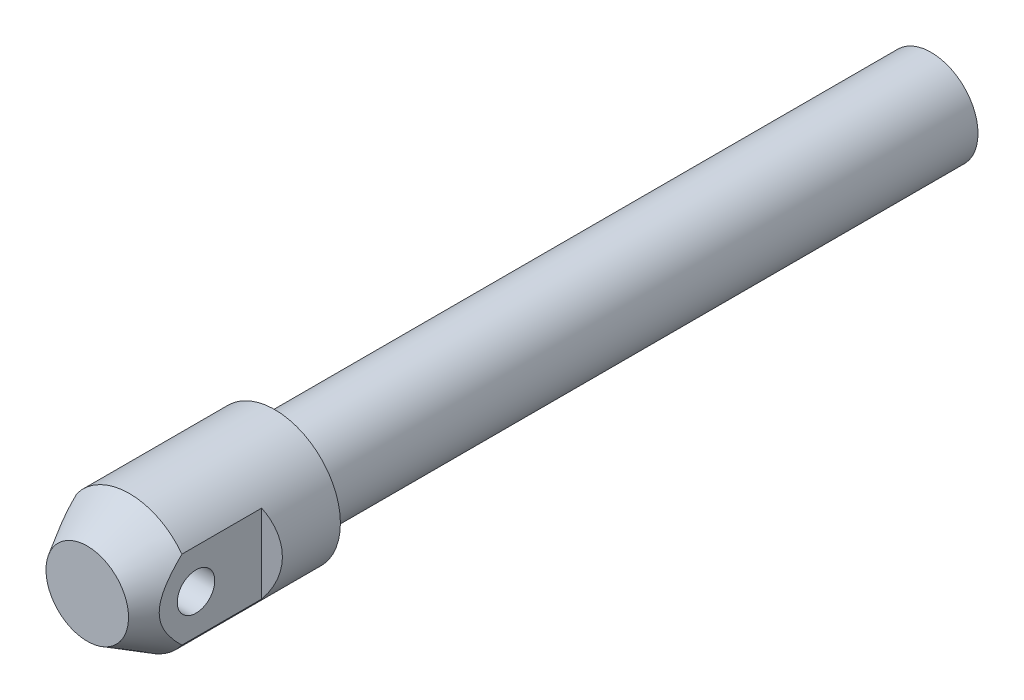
ISO-10303-21;
HEADER;
FILE_DESCRIPTION(('STEP AP214'),'2;1');
FILE_NAME('part.step','',(''),(''),'','','');
FILE_SCHEMA(('AUTOMOTIVE_DESIGN { 1 0 10303 214 1 1 1 1 }'));
ENDSEC;
DATA;
#1=APPLICATION_CONTEXT('core data for automotive mechanical design processes');
#2=APPLICATION_PROTOCOL_DEFINITION('international standard','automotive_design',2000,#1);
#3=PRODUCT_CONTEXT('',#1,'mechanical');
#4=PRODUCT('Part','Part','',(#3));
#5=PRODUCT_RELATED_PRODUCT_CATEGORY('part','',(#4));
#6=PRODUCT_DEFINITION_FORMATION('','',#4);
#7=PRODUCT_DEFINITION_CONTEXT('part definition',#1,'design');
#8=PRODUCT_DEFINITION('design','',#6,#7);
#9=PRODUCT_DEFINITION_SHAPE('','',#8);
#10=(LENGTH_UNIT() NAMED_UNIT(*) SI_UNIT(.MILLI.,.METRE.));
#11=(NAMED_UNIT(*) PLANE_ANGLE_UNIT() SI_UNIT($,.RADIAN.));
#12=(NAMED_UNIT(*) SI_UNIT($,.STERADIAN.) SOLID_ANGLE_UNIT());
#13=UNCERTAINTY_MEASURE_WITH_UNIT(LENGTH_MEASURE(1.E-05),#10,'distance_accuracy_value','');
#14=(GEOMETRIC_REPRESENTATION_CONTEXT(3) GLOBAL_UNCERTAINTY_ASSIGNED_CONTEXT((#13)) GLOBAL_UNIT_ASSIGNED_CONTEXT((#10,
#11,#12)) REPRESENTATION_CONTEXT('',''));
#15=CARTESIAN_POINT('',(0.,0.,0.));
#16=DIRECTION('',(0.,0.,1.));
#17=DIRECTION('',(1.,0.,0.));
#18=AXIS2_PLACEMENT_3D('',#15,#16,#17);
#19=CARTESIAN_POINT('',(0.,4.40192378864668,20.));
#20=DIRECTION('',(0.,0.,-1.));
#21=DIRECTION('',(-1.,0.,0.));
#22=AXIS2_PLACEMENT_3D('',#19,#20,#21);
#23=PLANE('',#22);
#24=CARTESIAN_POINT('',(0.,0.,19.9999999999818));
#25=DIRECTION('',(0.,0.,-1.));
#26=DIRECTION('',(0.,1.,0.));
#27=AXIS2_PLACEMENT_3D('',#24,#25,#26);
#28=CIRCLE('',#27,4.40192378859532);
#29=CARTESIAN_POINT('',(0.,4.40192378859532,19.9999999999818));
#30=VERTEX_POINT('',#29);
#31=EDGE_CURVE('E67',#30,#30,#28,.T.);
#32=ORIENTED_EDGE('',*,*,#31,.F.);
#33=EDGE_LOOP('',(#32));
#34=FACE_BOUND('',#33,.T.);
#35=ADVANCED_FACE('F14',(#34),#23,.F.);
#36=CARTESIAN_POINT('',(-5.6,-15.,7.));
#37=DIRECTION('',(0.5,0.,-0.866025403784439));
#38=DIRECTION('',(-0.866025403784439,0.,-0.5));
#39=AXIS2_PLACEMENT_3D('',#36,#37,#38);
#40=PLANE('',#39);
#41=CARTESIAN_POINT('',(0.,0.,10.2331615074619));
#42=DIRECTION('',(0.5,0.,-0.866025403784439));
#43=DIRECTION('',(0.866025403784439,0.,0.5));
#44=AXIS2_PLACEMENT_3D('',#41,#42,#43);
#45=ELLIPSE('',#44,8.08290376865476,7.);
#46=CARTESIAN_POINT('',(-5.6,-4.2,7.));
#47=VERTEX_POINT('',#46);
#48=CARTESIAN_POINT('',(-5.6,4.2,7.));
#49=VERTEX_POINT('',#48);
#50=EDGE_CURVE('E79',#47,#49,#45,.T.);
#51=ORIENTED_EDGE('',*,*,#50,.F.);
#52=DIRECTION('',(0.,1.,0.));
#53=VECTOR('',#52,1.);
#54=CARTESIAN_POINT('',(-5.6,-15.,7.));
#55=LINE('',#54,#53);
#56=EDGE_CURVE('E91',#49,#47,#55,.F.);
#57=ORIENTED_EDGE('',*,*,#56,.F.);
#58=EDGE_LOOP('',(#51,#57));
#59=FACE_BOUND('',#58,.T.);
#60=ADVANCED_FACE('F121',(#59),#40,.F.);
#61=CARTESIAN_POINT('',(-5.6,-15.,7.));
#62=DIRECTION('',(-1.,0.,0.));
#63=DIRECTION('',(0.,0.,1.));
#64=AXIS2_PLACEMENT_3D('',#61,#62,#63);
#65=PLANE('',#64);
#66=CARTESIAN_POINT('',(-5.6,0.,13.9999999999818));
#67=DIRECTION('',(-1.,0.,0.));
#68=DIRECTION('',(0.,0.,1.));
#69=AXIS2_PLACEMENT_3D('',#66,#67,#68);
#70=CIRCLE('',#69,2.);
#71=CARTESIAN_POINT('',(-5.6,0.,15.9999999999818));
#72=VERTEX_POINT('',#71);
#73=EDGE_CURVE('E93',#72,#72,#70,.T.);
#74=ORIENTED_EDGE('',*,*,#73,.F.);
#75=EDGE_LOOP('',(#74));
#76=FACE_BOUND('',#75,.T.);
#77=DIRECTION('',(0.,0.,1.));
#78=VECTOR('',#77,1.);
#79=CARTESIAN_POINT('',(-5.6,-4.2,20.));
#80=LINE('',#79,#78);
#81=CARTESIAN_POINT('',(-5.6,-4.19999999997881,15.4999999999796));
#82=VERTEX_POINT('',#81);
#83=EDGE_CURVE('E62',#82,#47,#80,.F.);
#84=ORIENTED_EDGE('',*,*,#83,.F.);
#85=CARTESIAN_POINT('',(-5.6,4.19999999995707,15.4999999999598));
#86=CARTESIAN_POINT('',(-5.6,4.12588051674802,15.5770212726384));
#87=CARTESIAN_POINT('',(-5.6,4.05111610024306,15.6534207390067));
#88=CARTESIAN_POINT('',(-5.6,3.90014030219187,15.8048001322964));
#89=CARTESIAN_POINT('',(-5.6,3.82392868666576,15.8797798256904));
#90=CARTESIAN_POINT('',(-5.6,3.59240323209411,16.1027893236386));
#91=CARTESIAN_POINT('',(-5.6,3.43469801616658,16.248366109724));
#92=CARTESIAN_POINT('',(-5.6,3.10718994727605,16.5346191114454));
#93=CARTESIAN_POINT('',(-5.6,2.93717458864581,16.6750538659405));
#94=CARTESIAN_POINT('',(-5.6,2.5874612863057,16.9430124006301));
#95=CARTESIAN_POINT('',(-5.6,2.40777795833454,17.0705548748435));
#96=CARTESIAN_POINT('',(-5.6,2.12283371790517,17.2525771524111));
#97=CARTESIAN_POINT('',(-5.6,2.02170711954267,17.3135078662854));
#98=CARTESIAN_POINT('',(-5.6,1.81591470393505,17.4290574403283));
#99=CARTESIAN_POINT('',(-5.6,1.71124829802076,17.4836752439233));
#100=CARTESIAN_POINT('',(-5.6,1.39309864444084,17.6354364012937));
#101=CARTESIAN_POINT('',(-5.6,1.17395556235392,17.7214927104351));
#102=CARTESIAN_POINT('',(-5.6,0.794735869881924,17.8312161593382));
#103=CARTESIAN_POINT('',(-5.6,0.637879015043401,17.8660052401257));
#104=CARTESIAN_POINT('',(-5.6,0.320655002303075,17.9128225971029));
#105=CARTESIAN_POINT('',(-5.6,0.160288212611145,17.9248532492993));
#106=CARTESIAN_POINT('',(-5.6,-0.109748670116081,17.9248833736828));
#107=CARTESIAN_POINT('',(-5.6,-0.219460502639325,17.9192639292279));
#108=CARTESIAN_POINT('',(-5.6,-0.437809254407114,17.8971029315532));
#109=CARTESIAN_POINT('',(-5.6,-0.546445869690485,17.880558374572));
#110=CARTESIAN_POINT('',(-5.6,-0.761854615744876,17.8372812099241));
#111=CARTESIAN_POINT('',(-5.6,-0.868622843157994,17.810529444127));
#112=CARTESIAN_POINT('',(-5.6,-1.0795086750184,17.7479393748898));
#113=CARTESIAN_POINT('',(-5.6,-1.18362433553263,17.7120946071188));
#114=CARTESIAN_POINT('',(-5.6,-1.431686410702,17.6159163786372));
#115=CARTESIAN_POINT('',(-5.6,-1.57409018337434,17.5516096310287));
#116=CARTESIAN_POINT('',(-5.6,-1.85250449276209,17.4105383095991));
#117=CARTESIAN_POINT('',(-5.6,-1.98851341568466,17.3337706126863));
#118=CARTESIAN_POINT('',(-5.6,-2.25523817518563,17.1701032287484));
#119=CARTESIAN_POINT('',(-5.6,-2.38592168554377,17.08315137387));
#120=CARTESIAN_POINT('',(-5.6,-2.64180229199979,16.9016462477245));
#121=CARTESIAN_POINT('',(-5.6,-2.76700068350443,16.8070947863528));
#122=CARTESIAN_POINT('',(-5.6,-3.00720000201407,16.6163075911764));
#123=CARTESIAN_POINT('',(-5.6,-3.1224071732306,16.520329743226));
#124=CARTESIAN_POINT('',(-5.6,-3.3490116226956,16.3239671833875));
#125=CARTESIAN_POINT('',(-5.6,-3.46040842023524,16.2235819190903));
#126=CARTESIAN_POINT('',(-5.6,-3.67810975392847,16.020883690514));
#127=CARTESIAN_POINT('',(-5.6,-3.78446727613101,15.918627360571));
#128=CARTESIAN_POINT('',(-5.6,-3.99428914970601,15.7112957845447));
#129=CARTESIAN_POINT('',(-5.6,-4.09775503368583,15.6062220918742));
#130=CARTESIAN_POINT('',(-5.6,-4.19999999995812,15.4999999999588));
#131=B_SPLINE_CURVE_WITH_KNOTS('',3,(#85,#86,#87,#88,#89,#90,#91,#92,#93,#94,#95,#96,#97,#98,
#99,#100,#101,#102,#103,#104,#105,#106,#107,#108,#109,#110,#111,#112,#113,#114,#115,#116,#117,
#118,#119,#120,#121,#122,#123,#124,#125,#126,#127,#128,#129,#130),.UNSPECIFIED.,.F.,.F.,(4,2,2,
2,2,2,2,2,2,2,2,2,2,2,2,2,2,2,2,2,2,2,4),(0.,0.320669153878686,0.641390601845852,
1.2850019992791,1.94614281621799,2.60631078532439,2.96029520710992,3.31433878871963,
4.01702361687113,4.49764226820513,4.97821073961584,5.30725396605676,5.63638769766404,
5.96614225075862,6.29613189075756,6.76405994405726,7.23210545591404,7.70266300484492,
8.17310881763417,8.62282088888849,9.07258948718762,9.51515369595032,9.95747871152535),.UNSPECIFIED.);
#132=CARTESIAN_POINT('',(-5.6,4.19999999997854,15.4999999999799));
#133=VERTEX_POINT('',#132);
#134=EDGE_CURVE('E54',#133,#82,#131,.T.);
#135=ORIENTED_EDGE('',*,*,#134,.F.);
#136=DIRECTION('',(0.,0.,1.));
#137=VECTOR('',#136,1.);
#138=CARTESIAN_POINT('',(-5.6,4.2,20.));
#139=LINE('',#138,#137);
#140=EDGE_CURVE('E59',#49,#133,#139,.T.);
#141=ORIENTED_EDGE('',*,*,#140,.F.);
#142=ORIENTED_EDGE('',*,*,#56,.T.);
#143=EDGE_LOOP('',(#84,#135,#141,#142));
#144=FACE_BOUND('',#143,.T.);
#145=ADVANCED_FACE('F56',(#76,#144),#65,.T.);
#146=CARTESIAN_POINT('',(0.,0.,15.5000000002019));
#147=DIRECTION('',(0.,0.,-1.));
#148=DIRECTION('',(0.,1.,0.));
#149=AXIS2_PLACEMENT_3D('',#146,#147,#148);
#150=CONICAL_SURFACE('',#149,6.99999999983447,0.52359877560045);
#151=CARTESIAN_POINT('',(0.,0.,15.5));
#152=DIRECTION('',(0.,0.,1.));
#153=DIRECTION('',(1.,0.,0.));
#154=AXIS2_PLACEMENT_3D('',#151,#152,#153);
#155=CIRCLE('',#154,7.);
#156=CARTESIAN_POINT('',(5.6,-4.19999999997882,15.4999999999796));
#157=VERTEX_POINT('',#156);
#158=EDGE_CURVE('E86',#157,#82,#155,.F.);
#159=ORIENTED_EDGE('',*,*,#158,.F.);
#160=CARTESIAN_POINT('',(5.6,-4.19999999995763,15.4999999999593));
#161=CARTESIAN_POINT('',(5.6,-4.12588051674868,15.5770212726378));
#162=CARTESIAN_POINT('',(5.6,-4.05111610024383,15.6534207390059));
#163=CARTESIAN_POINT('',(5.6,-3.90014030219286,15.8048001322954));
#164=CARTESIAN_POINT('',(5.6,-3.82392868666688,15.8797798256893));
#165=CARTESIAN_POINT('',(5.6,-3.5924032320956,16.1027893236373));
#166=CARTESIAN_POINT('',(5.6,-3.43469801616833,16.2483661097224));
#167=CARTESIAN_POINT('',(5.6,-3.10718994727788,16.5346191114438));
#168=CARTESIAN_POINT('',(5.59999999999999,-2.93717458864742,16.6750538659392));
#169=CARTESIAN_POINT('',(5.60000000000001,-2.58746128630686,16.9430124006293));
#170=CARTESIAN_POINT('',(5.60000000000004,-2.40777795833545,17.0705548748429));
#171=CARTESIAN_POINT('',(5.59999999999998,-2.12283371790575,17.2525771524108));
#172=CARTESIAN_POINT('',(5.59999999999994,-2.02170711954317,17.3135078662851));
#173=CARTESIAN_POINT('',(5.60000000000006,-1.81591470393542,17.4290574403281));
#174=CARTESIAN_POINT('',(5.60000000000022,-1.71124829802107,17.4836752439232));
#175=CARTESIAN_POINT('',(5.59999999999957,-1.39309864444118,17.6354364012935));
#176=CARTESIAN_POINT('',(5.59999999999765,-1.17395556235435,17.7214927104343));
#177=CARTESIAN_POINT('',(5.60000000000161,-0.794735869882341,17.8312161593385));
#178=CARTESIAN_POINT('',(5.60000000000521,-0.637879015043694,17.8660052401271));
#179=CARTESIAN_POINT('',(5.59999999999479,-0.320655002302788,17.9128225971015));
#180=CARTESIAN_POINT('',(5.59999999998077,-0.160288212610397,17.9248532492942));
#181=CARTESIAN_POINT('',(5.59999999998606,0.109748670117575,17.9248833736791));
#182=CARTESIAN_POINT('',(5.59999999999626,0.219460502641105,17.9192639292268));
#183=CARTESIAN_POINT('',(5.60000000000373,0.437809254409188,17.897102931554));
#184=CARTESIAN_POINT('',(5.600000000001,0.546445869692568,17.8805583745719));
#185=CARTESIAN_POINT('',(5.59999999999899,0.761854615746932,17.8372812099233));
#186=CARTESIAN_POINT('',(5.59999999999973,0.868622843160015,17.8105294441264));
#187=CARTESIAN_POINT('',(5.60000000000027,1.07950867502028,17.7479393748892));
#188=CARTESIAN_POINT('',(5.60000000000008,1.18362433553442,17.7120946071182));
#189=CARTESIAN_POINT('',(5.59999999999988,1.43168641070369,17.6159163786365));
#190=CARTESIAN_POINT('',(5.59999999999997,1.57409018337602,17.5516096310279));
#191=CARTESIAN_POINT('',(5.60000000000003,1.8525044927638,17.4105383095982));
#192=CARTESIAN_POINT('',(5.60000000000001,1.98851341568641,17.3337706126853));
#193=CARTESIAN_POINT('',(5.59999999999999,2.25523817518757,17.1701032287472));
#194=CARTESIAN_POINT('',(5.6,2.38592168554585,17.0831513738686));
#195=CARTESIAN_POINT('',(5.6,2.64180229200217,16.9016462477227));
#196=CARTESIAN_POINT('',(5.6,2.76700068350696,16.8070947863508));
#197=CARTESIAN_POINT('',(5.6,3.00720000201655,16.6163075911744));
#198=CARTESIAN_POINT('',(5.6,3.12240717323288,16.5203297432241));
#199=CARTESIAN_POINT('',(5.6,3.34901162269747,16.3239671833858));
#200=CARTESIAN_POINT('',(5.6,3.46040842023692,16.2235819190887));
#201=CARTESIAN_POINT('',(5.6,3.67810975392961,16.0208836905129));
#202=CARTESIAN_POINT('',(5.6,3.78446727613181,15.9186273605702));
#203=CARTESIAN_POINT('',(5.6,3.99428914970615,15.7112957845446));
#204=CARTESIAN_POINT('',(5.6,4.09775503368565,15.6062220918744));
#205=CARTESIAN_POINT('',(5.6,4.19999999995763,15.4999999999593));
#206=B_SPLINE_CURVE_WITH_KNOTS('',3,(#160,#161,#162,#163,#164,#165,#166,#167,#168,#169,#170,
#171,#172,#173,#174,#175,#176,#177,#178,#179,#180,#181,#182,#183,#184,#185,#186,#187,#188,#189,
#190,#191,#192,#193,#194,#195,#196,#197,#198,#199,#200,#201,#202,#203,#204,#205),.UNSPECIFIED.,
.F.,.F.,(4,2,2,2,2,2,2,2,2,2,2,2,2,2,2,2,2,2,2,2,2,2,4),(0.,0.320669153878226,0.641390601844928,
1.28500199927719,1.94614281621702,2.60631078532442,2.96029520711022,3.31433878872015,
4.01702361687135,4.49764226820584,4.97821073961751,5.30725396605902,5.63638769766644,
5.96614225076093,6.29613189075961,6.76405994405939,7.23210545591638,7.70266300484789,
8.17310881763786,8.62282088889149,9.0725894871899,9.51515369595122,9.95747871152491),.UNSPECIFIED.);
#207=CARTESIAN_POINT('',(5.6,4.19999999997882,15.4999999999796));
#208=VERTEX_POINT('',#207);
#209=EDGE_CURVE('E66',#157,#208,#206,.T.);
#210=ORIENTED_EDGE('',*,*,#209,.T.);
#211=CARTESIAN_POINT('',(0.,0.,15.5));
#212=DIRECTION('',(0.,0.,1.));
#213=DIRECTION('',(1.,0.,0.));
#214=AXIS2_PLACEMENT_3D('',#211,#212,#213);
#215=CIRCLE('',#214,7.);
#216=EDGE_CURVE('E70',#133,#208,#215,.F.);
#217=ORIENTED_EDGE('',*,*,#216,.F.);
#218=ORIENTED_EDGE('',*,*,#134,.T.);
#219=EDGE_LOOP('',(#159,#210,#217,#218));
#220=FACE_BOUND('',#219,.T.);
#221=ORIENTED_EDGE('',*,*,#31,.T.);
#222=EDGE_LOOP('',(#221));
#223=FACE_BOUND('',#222,.T.);
#224=ADVANCED_FACE('F71',(#220,#223),#150,.T.);
#225=CARTESIAN_POINT('',(5.6,-15.,7.));
#226=DIRECTION('',(-1.,0.,0.));
#227=DIRECTION('',(0.,0.,1.));
#228=AXIS2_PLACEMENT_3D('',#225,#226,#227);
#229=PLANE('',#228);
#230=CARTESIAN_POINT('',(5.6,0.,13.9999999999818));
#231=DIRECTION('',(-1.,0.,0.));
#232=DIRECTION('',(0.,0.,1.));
#233=AXIS2_PLACEMENT_3D('',#230,#231,#232);
#234=CIRCLE('',#233,2.);
#235=CARTESIAN_POINT('',(5.6,0.,15.9999999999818));
#236=VERTEX_POINT('',#235);
#237=EDGE_CURVE('E17',#236,#236,#234,.T.);
#238=ORIENTED_EDGE('',*,*,#237,.T.);
#239=EDGE_LOOP('',(#238));
#240=FACE_BOUND('',#239,.T.);
#241=DIRECTION('',(0.,1.,0.));
#242=VECTOR('',#241,1.);
#243=CARTESIAN_POINT('',(5.6,-15.,7.));
#244=LINE('',#243,#242);
#245=CARTESIAN_POINT('',(5.6,4.2,7.));
#246=VERTEX_POINT('',#245);
#247=CARTESIAN_POINT('',(5.6,-4.2,7.));
#248=VERTEX_POINT('',#247);
#249=EDGE_CURVE('E32',#246,#248,#244,.F.);
#250=ORIENTED_EDGE('',*,*,#249,.F.);
#251=DIRECTION('',(0.,0.,1.));
#252=VECTOR('',#251,1.);
#253=CARTESIAN_POINT('',(5.6,4.2,20.));
#254=LINE('',#253,#252);
#255=EDGE_CURVE('E75',#208,#246,#254,.F.);
#256=ORIENTED_EDGE('',*,*,#255,.F.);
#257=ORIENTED_EDGE('',*,*,#209,.F.);
#258=DIRECTION('',(0.,0.,1.));
#259=VECTOR('',#258,1.);
#260=CARTESIAN_POINT('',(5.6,-4.2,20.));
#261=LINE('',#260,#259);
#262=EDGE_CURVE('E87',#248,#157,#261,.T.);
#263=ORIENTED_EDGE('',*,*,#262,.F.);
#264=EDGE_LOOP('',(#250,#256,#257,#263));
#265=FACE_BOUND('',#264,.T.);
#266=ADVANCED_FACE('F113',(#240,#265),#229,.F.);
#267=CARTESIAN_POINT('',(5.6,-15.,7.));
#268=DIRECTION('',(0.5,0.,0.866025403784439));
#269=DIRECTION('',(0.866025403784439,0.,-0.5));
#270=AXIS2_PLACEMENT_3D('',#267,#268,#269);
#271=PLANE('',#270);
#272=ORIENTED_EDGE('',*,*,#249,.T.);
#273=CARTESIAN_POINT('',(0.,0.,10.2331615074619));
#274=DIRECTION('',(0.5,0.,0.866025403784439));
#275=DIRECTION('',(-0.866025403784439,0.,0.5));
#276=AXIS2_PLACEMENT_3D('',#273,#274,#275);
#277=ELLIPSE('',#276,8.08290376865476,7.);
#278=EDGE_CURVE('E100',#246,#248,#277,.F.);
#279=ORIENTED_EDGE('',*,*,#278,.F.);
#280=EDGE_LOOP('',(#272,#279));
#281=FACE_BOUND('',#280,.T.);
#282=ADVANCED_FACE('F153',(#281),#271,.T.);
#283=CARTESIAN_POINT('',(0.,0.,20.));
#284=DIRECTION('',(0.,0.,1.));
#285=DIRECTION('',(1.,0.,0.));
#286=AXIS2_PLACEMENT_3D('',#283,#284,#285);
#287=CYLINDRICAL_SURFACE('',#286,7.);
#288=ORIENTED_EDGE('',*,*,#83,.T.);
#289=ORIENTED_EDGE('',*,*,#50,.T.);
#290=ORIENTED_EDGE('',*,*,#140,.T.);
#291=ORIENTED_EDGE('',*,*,#216,.T.);
#292=ORIENTED_EDGE('',*,*,#255,.T.);
#293=ORIENTED_EDGE('',*,*,#278,.T.);
#294=ORIENTED_EDGE('',*,*,#262,.T.);
#295=ORIENTED_EDGE('',*,*,#158,.T.);
#296=EDGE_LOOP('',(#288,#289,#290,#291,#292,#293,#294,#295));
#297=FACE_BOUND('',#296,.T.);
#298=CARTESIAN_POINT('',(0.,0.,0.));
#299=DIRECTION('',(0.,0.,1.));
#300=DIRECTION('',(1.,0.,0.));
#301=AXIS2_PLACEMENT_3D('',#298,#299,#300);
#302=CIRCLE('',#301,7.);
#303=CARTESIAN_POINT('',(7.,0.,0.));
#304=VERTEX_POINT('',#303);
#305=EDGE_CURVE('E97',#304,#304,#302,.T.);
#306=ORIENTED_EDGE('',*,*,#305,.T.);
#307=EDGE_LOOP('',(#306));
#308=FACE_BOUND('',#307,.T.);
#309=ADVANCED_FACE('F77',(#297,#308),#287,.T.);
#310=CARTESIAN_POINT('',(0.,5.,-70.));
#311=DIRECTION('',(0.,0.,-1.));
#312=DIRECTION('',(-1.,0.,0.));
#313=AXIS2_PLACEMENT_3D('',#310,#311,#312);
#314=PLANE('',#313);
#315=CARTESIAN_POINT('',(0.,0.,-70.));
#316=DIRECTION('',(0.,0.,1.));
#317=DIRECTION('',(1.,0.,0.));
#318=AXIS2_PLACEMENT_3D('',#315,#316,#317);
#319=CIRCLE('',#318,5.);
#320=CARTESIAN_POINT('',(5.,0.,-70.));
#321=VERTEX_POINT('',#320);
#322=EDGE_CURVE('E23',#321,#321,#319,.T.);
#323=ORIENTED_EDGE('',*,*,#322,.F.);
#324=EDGE_LOOP('',(#323));
#325=FACE_BOUND('',#324,.T.);
#326=ADVANCED_FACE('F144',(#325),#314,.T.);
#327=CARTESIAN_POINT('',(0.,5.,0.));
#328=DIRECTION('',(0.,0.,1.));
#329=DIRECTION('',(1.,0.,0.));
#330=AXIS2_PLACEMENT_3D('',#327,#328,#329);
#331=PLANE('',#330);
#332=CARTESIAN_POINT('',(0.,0.,0.));
#333=DIRECTION('',(0.,0.,1.));
#334=DIRECTION('',(1.,0.,0.));
#335=AXIS2_PLACEMENT_3D('',#332,#333,#334);
#336=CIRCLE('',#335,5.);
#337=CARTESIAN_POINT('',(5.,0.,0.));
#338=VERTEX_POINT('',#337);
#339=EDGE_CURVE('E9',#338,#338,#336,.F.);
#340=ORIENTED_EDGE('',*,*,#339,.F.);
#341=EDGE_LOOP('',(#340));
#342=FACE_BOUND('',#341,.T.);
#343=ORIENTED_EDGE('',*,*,#305,.F.);
#344=EDGE_LOOP('',(#343));
#345=FACE_BOUND('',#344,.T.);
#346=ADVANCED_FACE('F134',(#342,#345),#331,.F.);
#347=CARTESIAN_POINT('',(0.,0.,20.));
#348=DIRECTION('',(0.,0.,1.));
#349=DIRECTION('',(1.,0.,0.));
#350=AXIS2_PLACEMENT_3D('',#347,#348,#349);
#351=CYLINDRICAL_SURFACE('',#350,5.);
#352=ORIENTED_EDGE('',*,*,#339,.T.);
#353=EDGE_LOOP('',(#352));
#354=FACE_BOUND('',#353,.T.);
#355=ORIENTED_EDGE('',*,*,#322,.T.);
#356=EDGE_LOOP('',(#355));
#357=FACE_BOUND('',#356,.T.);
#358=ADVANCED_FACE('F132',(#354,#357),#351,.T.);
#359=CARTESIAN_POINT('',(-7.,0.,13.9999999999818));
#360=DIRECTION('',(1.,0.,0.));
#361=DIRECTION('',(0.,0.,-1.));
#362=AXIS2_PLACEMENT_3D('',#359,#360,#361);
#363=CYLINDRICAL_SURFACE('',#362,2.);
#364=ORIENTED_EDGE('',*,*,#73,.T.);
#365=EDGE_LOOP('',(#364));
#366=FACE_BOUND('',#365,.T.);
#367=ORIENTED_EDGE('',*,*,#237,.F.);
#368=EDGE_LOOP('',(#367));
#369=FACE_BOUND('',#368,.T.);
#370=ADVANCED_FACE('F131',(#366,#369),#363,.F.);
#371=CLOSED_SHELL('',(#35,#60,#145,#224,#266,#282,#309,#326,#346,#358,#370));
#372=MANIFOLD_SOLID_BREP('B1',#371);
#373=ADVANCED_BREP_SHAPE_REPRESENTATION('',(#18,#372),#14);
#374=SHAPE_DEFINITION_REPRESENTATION(#9,#373);
ENDSEC;
END-ISO-10303-21;
